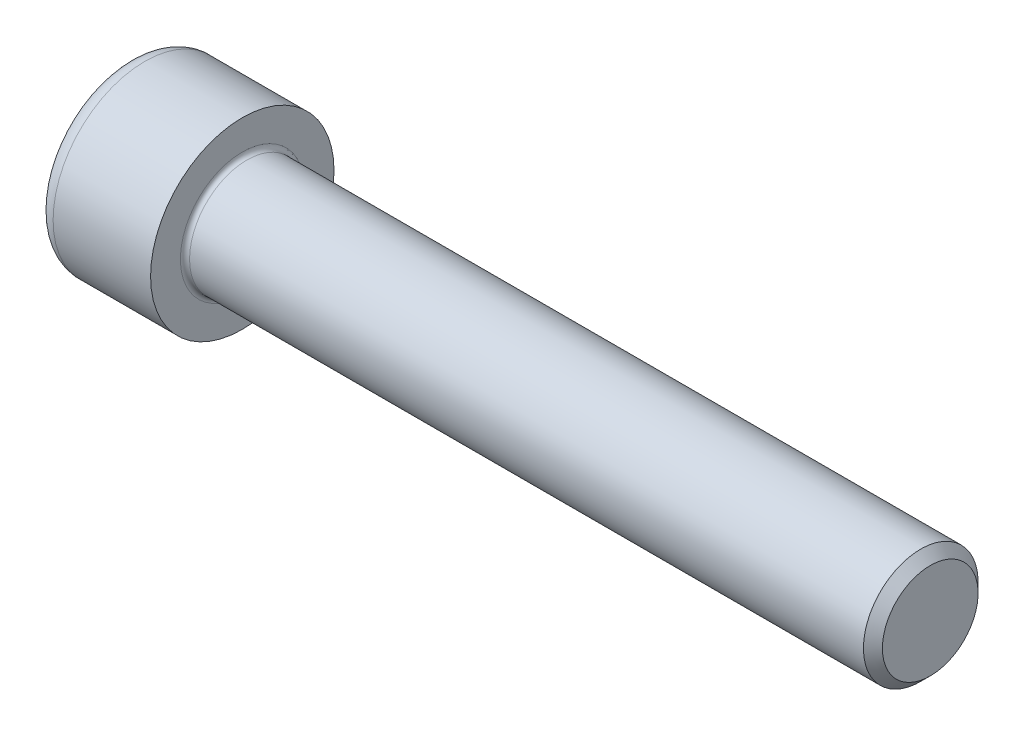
from build123d import *

# Parameters (mm, degrees)
FILLET1_R   = 0.4
FILLET2_R   = 1.5
HEX_2_DEPTH = 5


with BuildPart() as part:
    # BodySke → Base-Revolve (revolve)
    with BuildSketch(Plane.XY, mode=Mode.PRIVATE) as base_revolve_sk:
        Polygon((0, 0), (0, 8), (10, 8), (10, 5), (69.172, 5), (70, 4.172), (70, 0), align=None)
    revolve(base_revolve_sk.sketch.rotate(Axis((-31.75, 0, 0), (1, 0, 0)), 90), axis=Axis((-31.75, 0, 0), (1, 0, 0)))

    # Fillet1
    fillet1_edges = [part.edges().sort_by_distance(p)[0] for p in [
        (10, 0, -5),
    ]]
    fillet(fillet1_edges, radius=FILLET1_R)

    # Fillet2
    fillet2_edges = [part.edges().sort_by_distance(p)[0] for p in [
        (0, 0, -8),
    ]]
    fillet(fillet2_edges, radius=FILLET2_R)

    # Sketch2 → Hex-PreBroach (revolve, cut)
    with BuildSketch(Plane.XY, mode=Mode.PRIVATE) as hex_prebroach_sk:
        Polygon((0, 4.0575), (5, 4.0575), (7.342598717, 0), (0, 0), align=None)
    revolve(hex_prebroach_sk.sketch.rotate(Axis((0, 0, 0), (1, 0, 0)), 90), axis=Axis((0, 0, 0), (1, 0, 0)), mode=Mode.SUBTRACT)

    # Sketch3 → Hex 2 (cut)
    with BuildSketch(Plane(origin=(0, 0, 0), x_dir=(0, 0.500000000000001, 0.866025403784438), z_dir=(-1, 0, 0))):
        Polygon((2.342598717, 4.0575), (-2.342598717, 4.0575), (-4.685197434, 0), (-2.342598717, -4.0575), (2.342598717, -4.0575), (4.685197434, 0), align=None)
    extrude(amount=-HEX_2_DEPTH, mode=Mode.SUBTRACT)


solid = part.part
